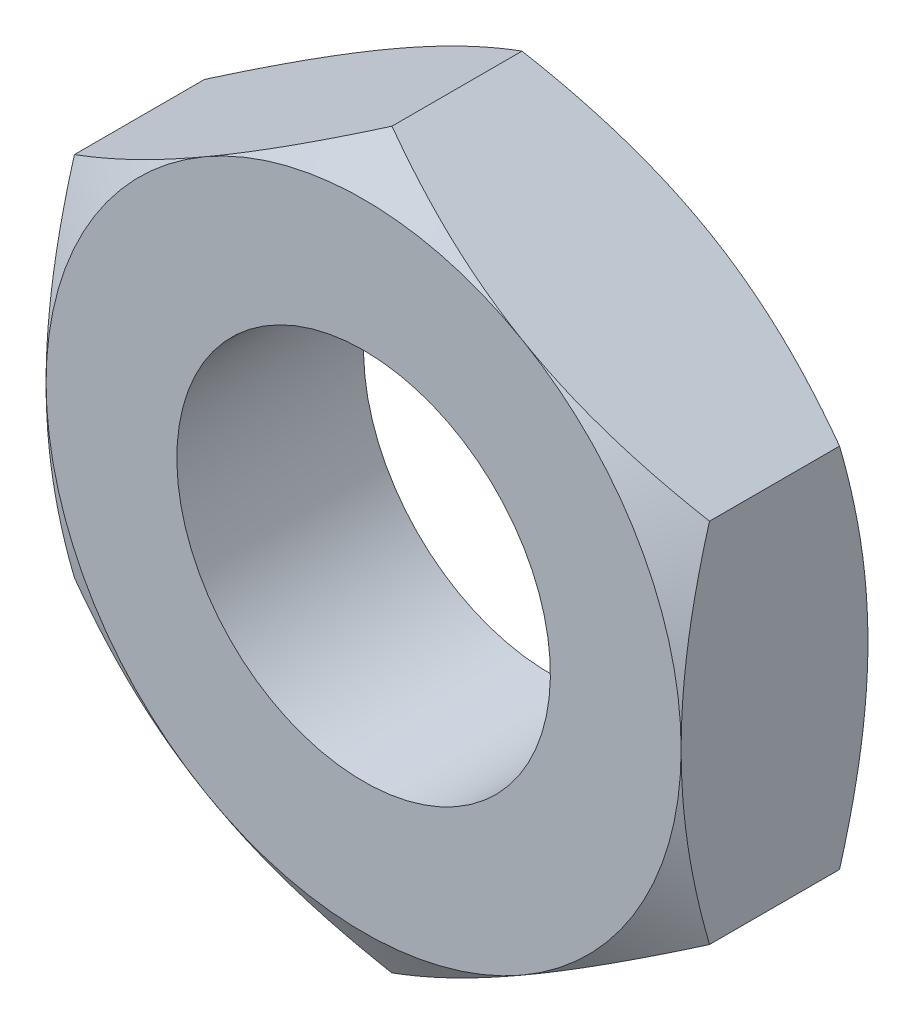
ISO-10303-21;
HEADER;
FILE_DESCRIPTION(('STEP AP214'),'2;1');
FILE_NAME('part.step','',(''),(''),'','','');
FILE_SCHEMA(('AUTOMOTIVE_DESIGN { 1 0 10303 214 1 1 1 1 }'));
ENDSEC;
DATA;
#1=APPLICATION_CONTEXT('core data for automotive mechanical design processes');
#2=APPLICATION_PROTOCOL_DEFINITION('international standard','automotive_design',2000,#1);
#3=PRODUCT_CONTEXT('',#1,'mechanical');
#4=PRODUCT('Part','Part','',(#3));
#5=PRODUCT_RELATED_PRODUCT_CATEGORY('part','',(#4));
#6=PRODUCT_DEFINITION_FORMATION('','',#4);
#7=PRODUCT_DEFINITION_CONTEXT('part definition',#1,'design');
#8=PRODUCT_DEFINITION('design','',#6,#7);
#9=PRODUCT_DEFINITION_SHAPE('','',#8);
#10=(LENGTH_UNIT() NAMED_UNIT(*) SI_UNIT(.MILLI.,.METRE.));
#11=(NAMED_UNIT(*) PLANE_ANGLE_UNIT() SI_UNIT($,.RADIAN.));
#12=(NAMED_UNIT(*) SI_UNIT($,.STERADIAN.) SOLID_ANGLE_UNIT());
#13=UNCERTAINTY_MEASURE_WITH_UNIT(LENGTH_MEASURE(1.E-05),#10,'distance_accuracy_value','');
#14=(GEOMETRIC_REPRESENTATION_CONTEXT(3) GLOBAL_UNCERTAINTY_ASSIGNED_CONTEXT((#13)) GLOBAL_UNIT_ASSIGNED_CONTEXT((#10,
#11,#12)) REPRESENTATION_CONTEXT('',''));
#15=CARTESIAN_POINT('',(0.,0.,0.));
#16=DIRECTION('',(0.,0.,1.));
#17=DIRECTION('',(1.,0.,0.));
#18=AXIS2_PLACEMENT_3D('',#15,#16,#17);
#19=CARTESIAN_POINT('',(0.,0.,5.));
#20=DIRECTION('',(0.,0.,-1.));
#21=DIRECTION('',(-1.,0.,0.));
#22=AXIS2_PLACEMENT_3D('',#19,#20,#21);
#23=CONICAL_SURFACE('',#22,8.5,1.04719755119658);
#24=CARTESIAN_POINT('',(0.000200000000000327,9.81507004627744,4.24074395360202));
#25=CARTESIAN_POINT('',(-0.18663922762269,9.7071983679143,4.30301386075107));
#26=CARTESIAN_POINT('',(-0.374175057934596,9.59892450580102,4.36245770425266));
#27=CARTESIAN_POINT('',(-0.750769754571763,9.38149745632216,4.47491488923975));
#28=CARTESIAN_POINT('',(-0.939829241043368,9.27234391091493,4.52792545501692));
#29=CARTESIAN_POINT('',(-1.5100347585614,8.94313560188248,4.67626661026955));
#30=CARTESIAN_POINT('',(-1.89343164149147,8.72178130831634,4.76064107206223));
#31=CARTESIAN_POINT('',(-2.46717766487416,8.39052888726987,4.85957998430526));
#32=CARTESIAN_POINT('',(-2.65581276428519,8.2816203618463,4.88776480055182));
#33=CARTESIAN_POINT('',(-3.03393602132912,8.06331079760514,4.93502591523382));
#34=CARTESIAN_POINT('',(-3.22342410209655,7.95390980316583,4.95410301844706));
#35=CARTESIAN_POINT('',(-3.60272652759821,7.73491944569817,4.98266522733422));
#36=CARTESIAN_POINT('',(-3.7925402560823,7.62533043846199,4.99216121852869));
#37=CARTESIAN_POINT('',(-4.17234305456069,7.40605119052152,5.00135762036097));
#38=CARTESIAN_POINT('',(-4.36233211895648,7.29636095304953,5.00105833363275));
#39=CARTESIAN_POINT('',(-4.71752301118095,7.09129139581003,4.99134552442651));
#40=CARTESIAN_POINT('',(-4.88274990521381,6.99589760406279,4.98311683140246));
#41=CARTESIAN_POINT('',(-5.21281671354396,6.80533344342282,4.95941075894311));
#42=CARTESIAN_POINT('',(-5.37765660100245,6.71016309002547,4.94393289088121));
#43=CARTESIAN_POINT('',(-5.87153810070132,6.42502047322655,4.88699137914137));
#44=CARTESIAN_POINT('',(-6.19970550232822,6.23555293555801,4.8350269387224));
#45=CARTESIAN_POINT('',(-6.85952142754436,5.85460803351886,4.70511505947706));
#46=CARTESIAN_POINT('',(-7.19108574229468,5.66317928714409,4.62661693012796));
#47=CARTESIAN_POINT('',(-7.84926989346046,5.28317649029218,4.44845866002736));
#48=CARTESIAN_POINT('',(-8.17589815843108,5.09459757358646,4.34884036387));
#49=CARTESIAN_POINT('',(-8.5002,4.90736181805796,4.240743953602));
#50=B_SPLINE_CURVE_WITH_KNOTS('',3,(#24,#25,#26,#27,#28,#29,#30,#31,#32,#33,#34,#35,#36,#37,#38,
#39,#40,#41,#42,#43,#44,#45,#46,#47,#48,#49),.UNSPECIFIED.,.F.,.F.,(4,2,2,2,2,2,2,2,2,2,2,2,4),
(0.,0.673596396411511,1.34748239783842,2.69805431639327,3.35679995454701,4.01548737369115,
4.67342558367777,5.33134346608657,5.90409556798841,6.47688628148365,7.62328361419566,
8.79510569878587,9.96462743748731),.UNSPECIFIED.);
#51=CARTESIAN_POINT('',(-4.25,7.36121593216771,5.));
#52=VERTEX_POINT('',#51);
#53=CARTESIAN_POINT('',(-8.5,4.9074772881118,4.24081062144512));
#54=VERTEX_POINT('',#53);
#55=EDGE_CURVE('E186',#52,#54,#50,.T.);
#56=ORIENTED_EDGE('',*,*,#55,.T.);
#57=CARTESIAN_POINT('',(-8.5,-13.2583613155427,0.814730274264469));
#58=CARTESIAN_POINT('',(-8.5,-12.8864728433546,0.995434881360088));
#59=CARTESIAN_POINT('',(-8.5,-12.5137388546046,1.17442879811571));
#60=CARTESIAN_POINT('',(-8.5,-11.7661304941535,1.52803467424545));
#61=CARTESIAN_POINT('',(-8.5,-11.3912558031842,1.70264595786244));
#62=CARTESIAN_POINT('',(-8.5,-10.6370214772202,2.04738824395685));
#63=CARTESIAN_POINT('',(-8.5,-10.2576485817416,2.21749033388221));
#64=CARTESIAN_POINT('',(-8.5,-9.4959121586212,2.55083491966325));
#65=CARTESIAN_POINT('',(-8.5,-9.11354877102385,2.71407773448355));
#66=CARTESIAN_POINT('',(-8.5,-8.33257141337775,3.03712878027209));
#67=CARTESIAN_POINT('',(-8.5,-7.93383684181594,3.19664704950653));
#68=CARTESIAN_POINT('',(-8.5,-7.13173193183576,3.50379441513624));
#69=CARTESIAN_POINT('',(-8.5,-6.72836108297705,3.65142218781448));
#70=CARTESIAN_POINT('',(-8.5,-5.91706772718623,3.93096834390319));
#71=CARTESIAN_POINT('',(-8.5,-5.50915607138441,4.06291788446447));
#72=CARTESIAN_POINT('',(-8.5,-4.68749602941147,4.30692544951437));
#73=CARTESIAN_POINT('',(-8.5,-4.27374950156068,4.41898965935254));
#74=CARTESIAN_POINT('',(-8.5,-3.44243879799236,4.61728915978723));
#75=CARTESIAN_POINT('',(-8.5,-3.02490979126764,4.70366793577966));
#76=CARTESIAN_POINT('',(-8.5,-2.39475362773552,4.81027425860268));
#77=CARTESIAN_POINT('',(-8.5,-2.18404284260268,4.8419841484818));
#78=CARTESIAN_POINT('',(-8.5,-1.76154817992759,4.89712987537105));
#79=CARTESIAN_POINT('',(-8.5,-1.54976440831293,4.92056651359));
#80=CARTESIAN_POINT('',(-8.5,-1.12820729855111,4.95840086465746));
#81=CARTESIAN_POINT('',(-8.5,-0.91844434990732,4.97291386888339));
#82=CARTESIAN_POINT('',(-8.5,-0.498492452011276,4.99305243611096));
#83=CARTESIAN_POINT('',(-8.5,-0.288303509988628,4.99867814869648));
#84=CARTESIAN_POINT('',(-8.5,0.13212380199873,5.00090766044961));
#85=CARTESIAN_POINT('',(-8.5,0.342362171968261,4.99751145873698));
#86=CARTESIAN_POINT('',(-8.5,0.762506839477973,4.98178120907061));
#87=CARTESIAN_POINT('',(-8.5,0.972413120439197,4.96944672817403));
#88=CARTESIAN_POINT('',(-8.5,1.47459584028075,4.92950835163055));
#89=CARTESIAN_POINT('',(-8.5,1.76655222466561,4.89779057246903));
#90=CARTESIAN_POINT('',(-8.5,2.34833414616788,4.81877651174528));
#91=CARTESIAN_POINT('',(-8.5,2.63815939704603,4.77147817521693));
#92=CARTESIAN_POINT('',(-8.5,3.50408791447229,4.60871721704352));
#93=CARTESIAN_POINT('',(-8.5,4.07632839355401,4.47241710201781));
#94=CARTESIAN_POINT('',(-8.5,4.9320574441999,4.23560024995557));
#95=CARTESIAN_POINT('',(-8.5,5.2199728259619,4.15015539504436));
#96=CARTESIAN_POINT('',(-8.5,5.79300843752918,3.97027401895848));
#97=CARTESIAN_POINT('',(-8.5,6.07812864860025,3.8758374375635));
#98=CARTESIAN_POINT('',(-8.5,6.64566101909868,3.67949746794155));
#99=CARTESIAN_POINT('',(-8.5,6.92807400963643,3.57759646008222));
#100=CARTESIAN_POINT('',(-8.5,7.49055258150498,3.36753821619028));
#101=CARTESIAN_POINT('',(-8.5,7.77061819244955,3.25938105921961));
#102=CARTESIAN_POINT('',(-8.5,8.43950907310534,2.99384209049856));
#103=CARTESIAN_POINT('',(-8.5,8.82734518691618,2.83397298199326));
#104=CARTESIAN_POINT('',(-8.5,9.59963868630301,2.50624803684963));
#105=CARTESIAN_POINT('',(-8.5,9.98409584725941,2.33839167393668));
#106=CARTESIAN_POINT('',(-8.5,10.7502727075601,1.99631700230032));
#107=CARTESIAN_POINT('',(-8.5,11.1319917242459,1.82209716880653));
#108=CARTESIAN_POINT('',(-8.5,11.8930641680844,1.46860050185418));
#109=CARTESIAN_POINT('',(-8.5,12.2724176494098,1.28932378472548));
#110=CARTESIAN_POINT('',(-8.5,13.0295958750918,0.926465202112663));
#111=CARTESIAN_POINT('',(-8.5,13.4074183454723,0.742878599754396));
#112=CARTESIAN_POINT('',(-8.5,14.1614093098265,0.372341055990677));
#113=CARTESIAN_POINT('',(-8.5,14.5375777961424,0.185390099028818));
#114=CARTESIAN_POINT('',(-8.5,15.6638995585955,-0.379549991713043));
#115=CARTESIAN_POINT('',(-8.5,16.4119764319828,-0.761678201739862));
#116=CARTESIAN_POINT('',(-8.5,17.8399453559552,-1.50045352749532));
#117=CARTESIAN_POINT('',(-8.5,18.5201676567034,-1.85646521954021));
#118=CARTESIAN_POINT('',(-8.5,19.8780810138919,-2.57334253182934));
#119=CARTESIAN_POINT('',(-8.5,20.5557719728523,-2.9342083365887));
#120=CARTESIAN_POINT('',(-8.5,21.9074097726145,-3.65867559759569));
#121=CARTESIAN_POINT('',(-8.5,22.5813617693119,-4.02226745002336));
#122=CARTESIAN_POINT('',(-8.5,23.9276518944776,-4.75233522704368));
#123=CARTESIAN_POINT('',(-8.5,24.5999901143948,-5.11881098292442));
#124=CARTESIAN_POINT('',(-8.5,25.2717370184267,-5.48636013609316));
#125=B_SPLINE_CURVE_WITH_KNOTS('',3,(#57,#58,#59,#60,#61,#62,#63,#64,#65,#66,#67,#68,#69,#70,
#71,#72,#73,#74,#75,#76,#77,#78,#79,#80,#81,#82,#83,#84,#85,#86,#87,#88,#89,#90,#91,#92,#93,#94,
#95,#96,#97,#98,#99,#100,#101,#102,#103,#104,#105,#106,#107,#108,#109,#110,#111,#112,#113,#114,
#115,#116,#117,#118,#119,#120,#121,#122,#123,#124),.UNSPECIFIED.,.F.,.F.,(4,2,2,2,2,2,2,2,2,2,2,
2,2,2,2,2,2,2,2,2,2,2,2,2,2,2,2,2,2,2,2,2,2,4),(0.,1.24041661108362,2.4810233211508,
3.72825657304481,4.97543176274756,6.26366261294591,7.55203667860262,8.83780596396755,
10.1231746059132,11.4012218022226,12.0403353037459,12.6793868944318,13.3099983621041,
13.9405992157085,14.5712001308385,15.2018315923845,16.0823582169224,16.9630010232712,
18.725232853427,19.6261358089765,20.5270447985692,21.4276677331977,22.3282792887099,
23.586638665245,24.8450810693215,26.1038270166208,27.3625440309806,28.6227160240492,
29.8828938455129,32.402892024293,34.7061342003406,37.0094641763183,39.306779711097,
41.6039618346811),.UNSPECIFIED.);
#126=CARTESIAN_POINT('',(-8.5,0.,5.));
#127=VERTEX_POINT('',#126);
#128=EDGE_CURVE('E210',#54,#127,#125,.F.);
#129=ORIENTED_EDGE('',*,*,#128,.T.);
#130=CARTESIAN_POINT('',(0.,0.,5.));
#131=DIRECTION('',(0.,0.,-1.));
#132=DIRECTION('',(-1.,0.,0.));
#133=AXIS2_PLACEMENT_3D('',#130,#131,#132);
#134=CIRCLE('',#133,8.5);
#135=EDGE_CURVE('E281',#127,#52,#134,.T.);
#136=ORIENTED_EDGE('',*,*,#135,.T.);
#137=EDGE_LOOP('',(#56,#129,#136));
#138=FACE_BOUND('',#137,.T.);
#139=ADVANCED_FACE('F14',(#138),#23,.T.);
#140=CARTESIAN_POINT('',(-4.25,-7.36121593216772,5.));
#141=VERTEX_POINT('',#140);
#142=EDGE_CURVE('E280',#141,#127,#134,.T.);
#143=ORIENTED_EDGE('',*,*,#142,.T.);
#144=CARTESIAN_POINT('',(-8.5,-4.9074772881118,4.24081062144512));
#145=VERTEX_POINT('',#144);
#146=EDGE_CURVE('E203',#127,#145,#125,.F.);
#147=ORIENTED_EDGE('',*,*,#146,.T.);
#148=CARTESIAN_POINT('',(-8.5002,-4.90736181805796,4.240743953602));
#149=CARTESIAN_POINT('',(-8.31336077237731,-5.0152334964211,4.30301386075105));
#150=CARTESIAN_POINT('',(-8.1258249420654,-5.12350735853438,4.36245770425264));
#151=CARTESIAN_POINT('',(-7.74923024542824,-5.34093440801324,4.47491488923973));
#152=CARTESIAN_POINT('',(-7.56017075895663,-5.45008795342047,4.5279254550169));
#153=CARTESIAN_POINT('',(-6.9899652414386,-5.77929626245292,4.67626661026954));
#154=CARTESIAN_POINT('',(-6.60656835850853,-6.00065055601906,4.76064107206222));
#155=CARTESIAN_POINT('',(-6.03282233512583,-6.33190297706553,4.85957998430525));
#156=CARTESIAN_POINT('',(-5.84418723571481,-6.4408115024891,4.88776480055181));
#157=CARTESIAN_POINT('',(-5.46606397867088,-6.65912106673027,4.93502591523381));
#158=CARTESIAN_POINT('',(-5.27657589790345,-6.76852206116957,4.95410301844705));
#159=CARTESIAN_POINT('',(-4.89727347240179,-6.98751241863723,4.98266522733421));
#160=CARTESIAN_POINT('',(-4.7074597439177,-7.09710142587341,4.99216121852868));
#161=CARTESIAN_POINT('',(-4.3276569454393,-7.31638067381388,5.00135762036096));
#162=CARTESIAN_POINT('',(-4.13766788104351,-7.42607091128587,5.00105833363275));
#163=CARTESIAN_POINT('',(-3.78247698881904,-7.63114046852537,4.99134552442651));
#164=CARTESIAN_POINT('',(-3.61725009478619,-7.72653426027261,4.98311683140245));
#165=CARTESIAN_POINT('',(-3.28718328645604,-7.91709842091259,4.9594107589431));
#166=CARTESIAN_POINT('',(-3.12234339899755,-8.01226877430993,4.94393289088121));
#167=CARTESIAN_POINT('',(-2.62846189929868,-8.29741139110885,4.88699137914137));
#168=CARTESIAN_POINT('',(-2.30029449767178,-8.4868789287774,4.83502693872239));
#169=CARTESIAN_POINT('',(-1.64047857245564,-8.86782383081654,4.70511505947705));
#170=CARTESIAN_POINT('',(-1.30891425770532,-9.05925257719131,4.62661693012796));
#171=CARTESIAN_POINT('',(-0.650730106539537,-9.43925537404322,4.44845866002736));
#172=CARTESIAN_POINT('',(-0.324101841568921,-9.62783429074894,4.34884036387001));
#173=CARTESIAN_POINT('',(0.000200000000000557,-9.81507004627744,4.24074395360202));
#174=B_SPLINE_CURVE_WITH_KNOTS('',3,(#148,#149,#150,#151,#152,#153,#154,#155,#156,#157,#158,
#159,#160,#161,#162,#163,#164,#165,#166,#167,#168,#169,#170,#171,#172,#173),.UNSPECIFIED.,.F.,
.F.,(4,2,2,2,2,2,2,2,2,2,2,2,4),(0.,0.673596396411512,1.34748239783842,2.69805431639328,
3.35679995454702,4.01548737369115,4.67342558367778,5.33134346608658,5.90409556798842,
6.47688628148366,7.62328361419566,8.79510569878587,9.96462743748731),.UNSPECIFIED.);
#175=EDGE_CURVE('E332',#145,#141,#174,.T.);
#176=ORIENTED_EDGE('',*,*,#175,.T.);
#177=EDGE_LOOP('',(#143,#147,#176));
#178=FACE_BOUND('',#177,.T.);
#179=ADVANCED_FACE('F243',(#178),#23,.T.);
#180=CARTESIAN_POINT('',(4.25,-7.36121593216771,5.));
#181=VERTEX_POINT('',#180);
#182=EDGE_CURVE('E277',#181,#141,#134,.T.);
#183=ORIENTED_EDGE('',*,*,#182,.T.);
#184=CARTESIAN_POINT('',(0.,-9.8149545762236,4.24081062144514));
#185=VERTEX_POINT('',#184);
#186=EDGE_CURVE('E219',#141,#185,#174,.T.);
#187=ORIENTED_EDGE('',*,*,#186,.T.);
#188=CARTESIAN_POINT('',(-0.000199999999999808,-9.81507004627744,4.24074395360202));
#189=CARTESIAN_POINT('',(0.186639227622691,-9.7071983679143,4.30301386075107));
#190=CARTESIAN_POINT('',(0.374175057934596,-9.59892450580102,4.36245770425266));
#191=CARTESIAN_POINT('',(0.750769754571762,-9.38149745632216,4.47491488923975));
#192=CARTESIAN_POINT('',(0.939829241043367,-9.27234391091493,4.52792545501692));
#193=CARTESIAN_POINT('',(1.5100347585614,-8.94313560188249,4.67626661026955));
#194=CARTESIAN_POINT('',(1.89343164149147,-8.72178130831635,4.76064107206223));
#195=CARTESIAN_POINT('',(2.46717766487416,-8.39052888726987,4.85957998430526));
#196=CARTESIAN_POINT('',(2.65581276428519,-8.2816203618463,4.88776480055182));
#197=CARTESIAN_POINT('',(3.03393602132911,-8.06331079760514,4.93502591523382));
#198=CARTESIAN_POINT('',(3.22342410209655,-7.95390980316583,4.95410301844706));
#199=CARTESIAN_POINT('',(3.60272652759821,-7.73491944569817,4.98266522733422));
#200=CARTESIAN_POINT('',(3.7925402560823,-7.62533043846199,4.99216121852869));
#201=CARTESIAN_POINT('',(4.17234305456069,-7.40605119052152,5.00135762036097));
#202=CARTESIAN_POINT('',(4.36233211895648,-7.29636095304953,5.00105833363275));
#203=CARTESIAN_POINT('',(4.71752301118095,-7.09129139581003,4.99134552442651));
#204=CARTESIAN_POINT('',(4.88274990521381,-6.99589760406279,4.98311683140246));
#205=CARTESIAN_POINT('',(5.21281671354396,-6.80533344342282,4.95941075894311));
#206=CARTESIAN_POINT('',(5.37765660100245,-6.71016309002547,4.94393289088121));
#207=CARTESIAN_POINT('',(5.87153810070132,-6.42502047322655,4.88699137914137));
#208=CARTESIAN_POINT('',(6.19970550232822,-6.23555293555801,4.8350269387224));
#209=CARTESIAN_POINT('',(6.85952142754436,-5.85460803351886,4.70511505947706));
#210=CARTESIAN_POINT('',(7.19108574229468,-5.66317928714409,4.62661693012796));
#211=CARTESIAN_POINT('',(7.84926989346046,-5.28317649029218,4.44845866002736));
#212=CARTESIAN_POINT('',(8.17589815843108,-5.09459757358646,4.34884036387));
#213=CARTESIAN_POINT('',(8.5002,-4.90736181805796,4.240743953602));
#214=B_SPLINE_CURVE_WITH_KNOTS('',3,(#188,#189,#190,#191,#192,#193,#194,#195,#196,#197,#198,
#199,#200,#201,#202,#203,#204,#205,#206,#207,#208,#209,#210,#211,#212,#213),.UNSPECIFIED.,.F.,
.F.,(4,2,2,2,2,2,2,2,2,2,2,2,4),(0.,0.673596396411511,1.34748239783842,2.69805431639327,
3.35679995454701,4.01548737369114,4.67342558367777,5.33134346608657,5.90409556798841,
6.47688628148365,7.62328361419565,8.79510569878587,9.96462743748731),.UNSPECIFIED.);
#215=EDGE_CURVE('E288',#185,#181,#214,.T.);
#216=ORIENTED_EDGE('',*,*,#215,.T.);
#217=EDGE_LOOP('',(#183,#187,#216));
#218=FACE_BOUND('',#217,.T.);
#219=ADVANCED_FACE('F248',(#218),#23,.T.);
#220=CARTESIAN_POINT('',(8.5002,4.90736181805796,4.240743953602));
#221=CARTESIAN_POINT('',(8.31336077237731,5.0152334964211,4.30301386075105));
#222=CARTESIAN_POINT('',(8.1258249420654,5.12350735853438,4.36245770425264));
#223=CARTESIAN_POINT('',(7.74923024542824,5.34093440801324,4.47491488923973));
#224=CARTESIAN_POINT('',(7.56017075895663,5.45008795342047,4.5279254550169));
#225=CARTESIAN_POINT('',(6.9899652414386,5.77929626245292,4.67626661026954));
#226=CARTESIAN_POINT('',(6.60656835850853,6.00065055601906,4.76064107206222));
#227=CARTESIAN_POINT('',(6.03282233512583,6.33190297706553,4.85957998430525));
#228=CARTESIAN_POINT('',(5.84418723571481,6.4408115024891,4.88776480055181));
#229=CARTESIAN_POINT('',(5.46606397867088,6.65912106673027,4.93502591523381));
#230=CARTESIAN_POINT('',(5.27657589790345,6.76852206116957,4.95410301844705));
#231=CARTESIAN_POINT('',(4.89727347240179,6.98751241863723,4.98266522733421));
#232=CARTESIAN_POINT('',(4.70745974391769,7.09710142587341,4.99216121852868));
#233=CARTESIAN_POINT('',(4.3276569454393,7.31638067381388,5.00135762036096));
#234=CARTESIAN_POINT('',(4.13766788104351,7.42607091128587,5.00105833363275));
#235=CARTESIAN_POINT('',(3.78247698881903,7.63114046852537,4.99134552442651));
#236=CARTESIAN_POINT('',(3.61725009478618,7.72653426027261,4.98311683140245));
#237=CARTESIAN_POINT('',(3.28718328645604,7.91709842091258,4.9594107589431));
#238=CARTESIAN_POINT('',(3.12234339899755,8.01226877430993,4.94393289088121));
#239=CARTESIAN_POINT('',(2.62846189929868,8.29741139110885,4.88699137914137));
#240=CARTESIAN_POINT('',(2.30029449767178,8.4868789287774,4.8350269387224));
#241=CARTESIAN_POINT('',(1.64047857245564,8.86782383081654,4.70511505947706));
#242=CARTESIAN_POINT('',(1.30891425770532,9.05925257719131,4.62661693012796));
#243=CARTESIAN_POINT('',(0.650730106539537,9.43925537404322,4.44845866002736));
#244=CARTESIAN_POINT('',(0.324101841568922,9.62783429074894,4.34884036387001));
#245=CARTESIAN_POINT('',(-0.000199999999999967,9.81507004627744,4.24074395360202));
#246=B_SPLINE_CURVE_WITH_KNOTS('',3,(#220,#221,#222,#223,#224,#225,#226,#227,#228,#229,#230,
#231,#232,#233,#234,#235,#236,#237,#238,#239,#240,#241,#242,#243,#244,#245),.UNSPECIFIED.,.F.,
.F.,(4,2,2,2,2,2,2,2,2,2,2,2,4),(0.,0.673596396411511,1.34748239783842,2.69805431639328,
3.35679995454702,4.01548737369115,4.67342558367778,5.33134346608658,5.90409556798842,
6.47688628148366,7.62328361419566,8.79510569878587,9.96462743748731),.UNSPECIFIED.);
#247=CARTESIAN_POINT('',(4.25,7.36121593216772,5.));
#248=VERTEX_POINT('',#247);
#249=CARTESIAN_POINT('',(0.,9.8149545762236,4.24081062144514));
#250=VERTEX_POINT('',#249);
#251=EDGE_CURVE('E141',#248,#250,#246,.T.);
#252=ORIENTED_EDGE('',*,*,#251,.T.);
#253=EDGE_CURVE('E193',#250,#52,#50,.T.);
#254=ORIENTED_EDGE('',*,*,#253,.T.);
#255=EDGE_CURVE('E278',#52,#248,#134,.T.);
#256=ORIENTED_EDGE('',*,*,#255,.T.);
#257=EDGE_LOOP('',(#252,#254,#256));
#258=FACE_BOUND('',#257,.T.);
#259=ADVANCED_FACE('F259',(#258),#23,.T.);
#260=CARTESIAN_POINT('',(8.5,0.,5.));
#261=VERTEX_POINT('',#260);
#262=EDGE_CURVE('E271',#261,#181,#134,.T.);
#263=ORIENTED_EDGE('',*,*,#262,.T.);
#264=CARTESIAN_POINT('',(8.5,-4.9074772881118,4.24081062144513));
#265=VERTEX_POINT('',#264);
#266=EDGE_CURVE('E272',#181,#265,#214,.T.);
#267=ORIENTED_EDGE('',*,*,#266,.T.);
#268=CARTESIAN_POINT('',(8.5,-13.2583613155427,0.81473027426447));
#269=CARTESIAN_POINT('',(8.5,-12.8864728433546,0.99543488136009));
#270=CARTESIAN_POINT('',(8.5,-12.5137388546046,1.17442879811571));
#271=CARTESIAN_POINT('',(8.5,-11.7661304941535,1.52803467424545));
#272=CARTESIAN_POINT('',(8.5,-11.3912558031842,1.70264595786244));
#273=CARTESIAN_POINT('',(8.5,-10.6370214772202,2.04738824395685));
#274=CARTESIAN_POINT('',(8.5,-10.2576485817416,2.21749033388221));
#275=CARTESIAN_POINT('',(8.5,-9.49591215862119,2.55083491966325));
#276=CARTESIAN_POINT('',(8.5,-9.11354877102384,2.71407773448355));
#277=CARTESIAN_POINT('',(8.5,-8.33257141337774,3.0371287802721));
#278=CARTESIAN_POINT('',(8.5,-7.93383684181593,3.19664704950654));
#279=CARTESIAN_POINT('',(8.5,-7.13173193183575,3.50379441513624));
#280=CARTESIAN_POINT('',(8.5,-6.72836108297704,3.65142218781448));
#281=CARTESIAN_POINT('',(8.5,-5.91706772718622,3.93096834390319));
#282=CARTESIAN_POINT('',(8.5,-5.50915607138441,4.06291788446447));
#283=CARTESIAN_POINT('',(8.5,-4.68749602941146,4.30692544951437));
#284=CARTESIAN_POINT('',(8.5,-4.27374950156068,4.41898965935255));
#285=CARTESIAN_POINT('',(8.5,-3.44243879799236,4.61728915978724));
#286=CARTESIAN_POINT('',(8.5,-3.02490979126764,4.70366793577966));
#287=CARTESIAN_POINT('',(8.5,-2.39475362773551,4.81027425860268));
#288=CARTESIAN_POINT('',(8.5,-2.18404284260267,4.8419841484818));
#289=CARTESIAN_POINT('',(8.5,-1.76154817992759,4.89712987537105));
#290=CARTESIAN_POINT('',(8.5,-1.54976440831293,4.92056651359));
#291=CARTESIAN_POINT('',(8.5,-1.12820729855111,4.95840086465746));
#292=CARTESIAN_POINT('',(8.5,-0.91844434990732,4.97291386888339));
#293=CARTESIAN_POINT('',(8.5,-0.498492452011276,4.99305243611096));
#294=CARTESIAN_POINT('',(8.5,-0.288303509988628,4.99867814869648));
#295=CARTESIAN_POINT('',(8.5,0.13212380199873,5.00090766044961));
#296=CARTESIAN_POINT('',(8.5,0.34236217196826,4.99751145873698));
#297=CARTESIAN_POINT('',(8.5,0.762506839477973,4.98178120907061));
#298=CARTESIAN_POINT('',(8.5,0.972413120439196,4.96944672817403));
#299=CARTESIAN_POINT('',(8.5,1.47459584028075,4.92950835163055));
#300=CARTESIAN_POINT('',(8.5,1.76655222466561,4.89779057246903));
#301=CARTESIAN_POINT('',(8.5,2.34833414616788,4.81877651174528));
#302=CARTESIAN_POINT('',(8.5,2.63815939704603,4.77147817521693));
#303=CARTESIAN_POINT('',(8.5,3.50408791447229,4.60871721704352));
#304=CARTESIAN_POINT('',(8.5,4.07632839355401,4.47241710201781));
#305=CARTESIAN_POINT('',(8.5,4.9320574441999,4.23560024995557));
#306=CARTESIAN_POINT('',(8.5,5.2199728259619,4.15015539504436));
#307=CARTESIAN_POINT('',(8.5,5.79300843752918,3.97027401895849));
#308=CARTESIAN_POINT('',(8.5,6.07812864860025,3.8758374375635));
#309=CARTESIAN_POINT('',(8.5,6.64566101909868,3.67949746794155));
#310=CARTESIAN_POINT('',(8.5,6.92807400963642,3.57759646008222));
#311=CARTESIAN_POINT('',(8.5,7.49055258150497,3.36753821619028));
#312=CARTESIAN_POINT('',(8.5,7.77061819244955,3.25938105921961));
#313=CARTESIAN_POINT('',(8.5,8.43950907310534,2.99384209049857));
#314=CARTESIAN_POINT('',(8.5,8.82734518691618,2.83397298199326));
#315=CARTESIAN_POINT('',(8.5,9.599638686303,2.50624803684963));
#316=CARTESIAN_POINT('',(8.5,9.98409584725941,2.33839167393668));
#317=CARTESIAN_POINT('',(8.5,10.7502727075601,1.99631700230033));
#318=CARTESIAN_POINT('',(8.5,11.1319917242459,1.82209716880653));
#319=CARTESIAN_POINT('',(8.5,11.8930641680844,1.46860050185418));
#320=CARTESIAN_POINT('',(8.5,12.2724176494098,1.28932378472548));
#321=CARTESIAN_POINT('',(8.5,13.0295958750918,0.926465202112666));
#322=CARTESIAN_POINT('',(8.5,13.4074183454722,0.742878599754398));
#323=CARTESIAN_POINT('',(8.5,14.1614093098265,0.372341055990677));
#324=CARTESIAN_POINT('',(8.5,14.5375777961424,0.185390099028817));
#325=CARTESIAN_POINT('',(8.5,15.6638995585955,-0.379549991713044));
#326=CARTESIAN_POINT('',(8.5,16.4119764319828,-0.761678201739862));
#327=CARTESIAN_POINT('',(8.5,17.8399453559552,-1.50045352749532));
#328=CARTESIAN_POINT('',(8.5,18.5201676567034,-1.85646521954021));
#329=CARTESIAN_POINT('',(8.5,19.8780810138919,-2.57334253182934));
#330=CARTESIAN_POINT('',(8.5,20.5557719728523,-2.9342083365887));
#331=CARTESIAN_POINT('',(8.5,21.9074097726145,-3.65867559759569));
#332=CARTESIAN_POINT('',(8.5,22.5813617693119,-4.02226745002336));
#333=CARTESIAN_POINT('',(8.5,23.9276518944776,-4.75233522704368));
#334=CARTESIAN_POINT('',(8.5,24.5999901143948,-5.11881098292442));
#335=CARTESIAN_POINT('',(8.5,25.2717370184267,-5.48636013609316));
#336=B_SPLINE_CURVE_WITH_KNOTS('',3,(#268,#269,#270,#271,#272,#273,#274,#275,#276,#277,#278,
#279,#280,#281,#282,#283,#284,#285,#286,#287,#288,#289,#290,#291,#292,#293,#294,#295,#296,#297,
#298,#299,#300,#301,#302,#303,#304,#305,#306,#307,#308,#309,#310,#311,#312,#313,#314,#315,#316,
#317,#318,#319,#320,#321,#322,#323,#324,#325,#326,#327,#328,#329,#330,#331,#332,#333,#334,#335),
.UNSPECIFIED.,.F.,.F.,(4,2,2,2,2,2,2,2,2,2,2,2,2,2,2,2,2,2,2,2,2,2,2,2,2,2,2,2,2,2,2,2,2,4),(0.,
1.24041661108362,2.48102332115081,3.72825657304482,4.97543176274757,6.26366261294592,
7.55203667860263,8.83780596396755,10.1231746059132,11.4012218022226,12.0403353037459,
12.6793868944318,13.3099983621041,13.9405992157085,14.5712001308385,15.2018315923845,
16.0823582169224,16.9630010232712,18.725232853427,19.6261358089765,20.5270447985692,
21.4276677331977,22.3282792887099,23.586638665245,24.8450810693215,26.1038270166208,
27.3625440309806,28.6227160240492,29.8828938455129,32.402892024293,34.7061342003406,
37.0094641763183,39.306779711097,41.6039618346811),.UNSPECIFIED.);
#337=EDGE_CURVE('E146',#265,#261,#336,.T.);
#338=ORIENTED_EDGE('',*,*,#337,.T.);
#339=EDGE_LOOP('',(#263,#267,#338));
#340=FACE_BOUND('',#339,.T.);
#341=ADVANCED_FACE('F252',(#340),#23,.T.);
#342=CARTESIAN_POINT('',(0.,0.,2.5));
#343=DIRECTION('',(0.,0.,1.));
#344=DIRECTION('',(1.,0.,0.));
#345=AXIS2_PLACEMENT_3D('',#342,#343,#344);
#346=CONICAL_SURFACE('',#345,12.830127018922,1.04719755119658);
#347=CARTESIAN_POINT('',(8.5,-13.2583613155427,4.18526972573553));
#348=CARTESIAN_POINT('',(8.5,-12.8864728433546,4.00456511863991));
#349=CARTESIAN_POINT('',(8.5,-12.5137388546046,3.82557120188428));
#350=CARTESIAN_POINT('',(8.5,-11.7661304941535,3.47196532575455));
#351=CARTESIAN_POINT('',(8.5,-11.3912558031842,3.29735404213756));
#352=CARTESIAN_POINT('',(8.5,-10.6370214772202,2.95261175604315));
#353=CARTESIAN_POINT('',(8.5,-10.2576485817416,2.78250966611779));
#354=CARTESIAN_POINT('',(8.5,-9.49591215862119,2.44916508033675));
#355=CARTESIAN_POINT('',(8.5,-9.11354877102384,2.28592226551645));
#356=CARTESIAN_POINT('',(8.5,-8.33257141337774,1.9628712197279));
#357=CARTESIAN_POINT('',(8.5,-7.93383684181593,1.80335295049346));
#358=CARTESIAN_POINT('',(8.5,-7.13173193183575,1.49620558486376));
#359=CARTESIAN_POINT('',(8.5,-6.72836108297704,1.34857781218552));
#360=CARTESIAN_POINT('',(8.5,-5.91706772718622,1.0690316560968));
#361=CARTESIAN_POINT('',(8.5,-5.5091560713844,0.937082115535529));
#362=CARTESIAN_POINT('',(8.5,-4.68749602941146,0.693074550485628));
#363=CARTESIAN_POINT('',(8.5,-4.27374950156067,0.58101034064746));
#364=CARTESIAN_POINT('',(8.5,-3.44243879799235,0.382710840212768));
#365=CARTESIAN_POINT('',(8.5,-3.02490979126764,0.296332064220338));
#366=CARTESIAN_POINT('',(8.5,-2.39475362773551,0.189725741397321));
#367=CARTESIAN_POINT('',(8.5,-2.18404284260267,0.158015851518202));
#368=CARTESIAN_POINT('',(8.5,-1.76154817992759,0.102870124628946));
#369=CARTESIAN_POINT('',(8.5,-1.54976440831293,0.0794334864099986));
#370=CARTESIAN_POINT('',(8.5,-1.12820729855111,0.0415991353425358));
#371=CARTESIAN_POINT('',(8.5,-0.918444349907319,0.0270861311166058));
#372=CARTESIAN_POINT('',(8.5,-0.498492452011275,0.00694756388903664));
#373=CARTESIAN_POINT('',(8.5,-0.288303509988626,0.00132185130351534));
#374=CARTESIAN_POINT('',(8.5,0.132123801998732,-0.000907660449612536));
#375=CARTESIAN_POINT('',(8.5,0.342362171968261,0.00248854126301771));
#376=CARTESIAN_POINT('',(8.5,0.762506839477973,0.0182187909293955));
#377=CARTESIAN_POINT('',(8.5,0.972413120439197,0.0305532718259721));
#378=CARTESIAN_POINT('',(8.5,1.47459584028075,0.0704916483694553));
#379=CARTESIAN_POINT('',(8.5,1.76655222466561,0.102209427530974));
#380=CARTESIAN_POINT('',(8.5,2.34833414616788,0.181223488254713));
#381=CARTESIAN_POINT('',(8.5,2.63815939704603,0.228521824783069));
#382=CARTESIAN_POINT('',(8.5,3.50408791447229,0.391282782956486));
#383=CARTESIAN_POINT('',(8.5,4.07632839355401,0.527582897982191));
#384=CARTESIAN_POINT('',(8.5,4.9320574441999,0.764399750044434));
#385=CARTESIAN_POINT('',(8.5,5.2199728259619,0.849844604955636));
#386=CARTESIAN_POINT('',(8.5,5.79300843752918,1.02972598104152));
#387=CARTESIAN_POINT('',(8.5,6.07812864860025,1.1241625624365));
#388=CARTESIAN_POINT('',(8.5,6.64566101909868,1.32050253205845));
#389=CARTESIAN_POINT('',(8.5,6.92807400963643,1.42240353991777));
#390=CARTESIAN_POINT('',(8.5,7.49055258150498,1.63246178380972));
#391=CARTESIAN_POINT('',(8.5,7.77061819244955,1.74061894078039));
#392=CARTESIAN_POINT('',(8.5,8.43950907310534,2.00615790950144));
#393=CARTESIAN_POINT('',(8.5,8.82734518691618,2.16602701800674));
#394=CARTESIAN_POINT('',(8.5,9.59963868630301,2.49375196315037));
#395=CARTESIAN_POINT('',(8.5,9.98409584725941,2.66160832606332));
#396=CARTESIAN_POINT('',(8.5,10.7502727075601,3.00368299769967));
#397=CARTESIAN_POINT('',(8.5,11.1319917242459,3.17790283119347));
#398=CARTESIAN_POINT('',(8.5,11.8930641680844,3.53139949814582));
#399=CARTESIAN_POINT('',(8.5,12.2724176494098,3.71067621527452));
#400=CARTESIAN_POINT('',(8.5,13.0295958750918,4.07353479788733));
#401=CARTESIAN_POINT('',(8.5,13.4074183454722,4.2571214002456));
#402=CARTESIAN_POINT('',(8.5,14.1614093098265,4.62765894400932));
#403=CARTESIAN_POINT('',(8.5,14.5375777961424,4.81460990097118));
#404=CARTESIAN_POINT('',(8.5,15.6638995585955,5.37954999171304));
#405=CARTESIAN_POINT('',(8.5,16.4119764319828,5.76167820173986));
#406=CARTESIAN_POINT('',(8.5,17.8399453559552,6.50045352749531));
#407=CARTESIAN_POINT('',(8.5,18.5201676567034,6.8564652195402));
#408=CARTESIAN_POINT('',(8.5,19.8780810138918,7.57334253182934));
#409=CARTESIAN_POINT('',(8.5,20.5557719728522,7.9342083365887));
#410=CARTESIAN_POINT('',(8.5,21.9074097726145,8.65867559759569));
#411=CARTESIAN_POINT('',(8.5,22.5813617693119,9.02226745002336));
#412=CARTESIAN_POINT('',(8.5,23.9276518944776,9.75233522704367));
#413=CARTESIAN_POINT('',(8.5,24.5999901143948,10.1188109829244));
#414=CARTESIAN_POINT('',(8.5,25.2717370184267,10.4863601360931));
#415=B_SPLINE_CURVE_WITH_KNOTS('',3,(#347,#348,#349,#350,#351,#352,#353,#354,#355,#356,#357,
#358,#359,#360,#361,#362,#363,#364,#365,#366,#367,#368,#369,#370,#371,#372,#373,#374,#375,#376,
#377,#378,#379,#380,#381,#382,#383,#384,#385,#386,#387,#388,#389,#390,#391,#392,#393,#394,#395,
#396,#397,#398,#399,#400,#401,#402,#403,#404,#405,#406,#407,#408,#409,#410,#411,#412,#413,#414),
.UNSPECIFIED.,.F.,.F.,(4,2,2,2,2,2,2,2,2,2,2,2,2,2,2,2,2,2,2,2,2,2,2,2,2,2,2,2,2,2,2,2,2,4),(0.,
1.24041661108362,2.48102332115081,3.72825657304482,4.97543176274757,6.26366261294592,
7.55203667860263,8.83780596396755,10.1231746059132,11.4012218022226,12.0403353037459,
12.6793868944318,13.3099983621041,13.9405992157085,14.5712001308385,15.2018315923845,
16.0823582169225,16.9630010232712,18.725232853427,19.6261358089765,20.5270447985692,
21.4276677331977,22.3282792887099,23.586638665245,24.8450810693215,26.1038270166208,
27.3625440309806,28.6227160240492,29.8828938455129,32.402892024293,34.7061342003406,
37.0094641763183,39.306779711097,41.603961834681),.UNSPECIFIED.);
#416=CARTESIAN_POINT('',(8.5,0.,0.));
#417=VERTEX_POINT('',#416);
#418=CARTESIAN_POINT('',(8.5,-4.9074772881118,0.759189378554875));
#419=VERTEX_POINT('',#418);
#420=EDGE_CURVE('E102',#417,#419,#415,.F.);
#421=ORIENTED_EDGE('',*,*,#420,.T.);
#422=CARTESIAN_POINT('',(8.5002,-4.90736181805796,0.759256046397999));
#423=CARTESIAN_POINT('',(8.3133607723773,-5.0152334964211,0.696986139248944));
#424=CARTESIAN_POINT('',(8.1258249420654,-5.12350735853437,0.637542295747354));
#425=CARTESIAN_POINT('',(7.74923024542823,-5.34093440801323,0.525085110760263));
#426=CARTESIAN_POINT('',(7.56017075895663,-5.45008795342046,0.47207454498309));
#427=CARTESIAN_POINT('',(6.98996524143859,-5.77929626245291,0.323733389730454));
#428=CARTESIAN_POINT('',(6.60656835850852,-6.00065055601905,0.239358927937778));
#429=CARTESIAN_POINT('',(6.03282233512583,-6.33190297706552,0.140420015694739));
#430=CARTESIAN_POINT('',(5.8441872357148,-6.44081150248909,0.11223519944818));
#431=CARTESIAN_POINT('',(5.46606397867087,-6.65912106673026,0.0649740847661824));
#432=CARTESIAN_POINT('',(5.27657589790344,-6.76852206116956,0.045896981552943));
#433=CARTESIAN_POINT('',(4.89727347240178,-6.98751241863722,0.0173347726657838));
#434=CARTESIAN_POINT('',(4.70745974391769,-7.0971014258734,0.00783878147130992));
#435=CARTESIAN_POINT('',(4.3276569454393,-7.31638067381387,-0.0013576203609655));
#436=CARTESIAN_POINT('',(4.13766788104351,-7.42607091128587,-0.00105833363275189));
#437=CARTESIAN_POINT('',(3.78247698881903,-7.63114046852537,0.00865447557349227));
#438=CARTESIAN_POINT('',(3.61725009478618,-7.7265342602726,0.0168831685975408));
#439=CARTESIAN_POINT('',(3.28718328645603,-7.91709842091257,0.0405892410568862));
#440=CARTESIAN_POINT('',(3.12234339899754,-8.01226877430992,0.0560671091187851));
#441=CARTESIAN_POINT('',(2.62846189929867,-8.29741139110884,0.113008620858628));
#442=CARTESIAN_POINT('',(2.30029449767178,-8.48687892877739,0.164973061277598));
#443=CARTESIAN_POINT('',(1.64047857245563,-8.86782383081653,0.294884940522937));
#444=CARTESIAN_POINT('',(1.30891425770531,-9.0592525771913,0.373383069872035));
#445=CARTESIAN_POINT('',(0.650730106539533,-9.43925537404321,0.551541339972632));
#446=CARTESIAN_POINT('',(0.324101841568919,-9.62783429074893,0.651159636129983));
#447=CARTESIAN_POINT('',(-0.000199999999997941,-9.81507004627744,0.759256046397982));
#448=B_SPLINE_CURVE_WITH_KNOTS('',3,(#422,#423,#424,#425,#426,#427,#428,#429,#430,#431,#432,
#433,#434,#435,#436,#437,#438,#439,#440,#441,#442,#443,#444,#445,#446,#447),.UNSPECIFIED.,.F.,
.F.,(4,2,2,2,2,2,2,2,2,2,2,2,4),(0.,0.673596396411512,1.34748239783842,2.69805431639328,
3.35679995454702,4.01548737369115,4.67342558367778,5.33134346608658,5.90409556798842,
6.47688628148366,7.62328361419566,8.79510569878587,9.96462743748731),.UNSPECIFIED.);
#449=CARTESIAN_POINT('',(4.25,-7.36121593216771,0.));
#450=VERTEX_POINT('',#449);
#451=EDGE_CURVE('E123',#419,#450,#448,.T.);
#452=ORIENTED_EDGE('',*,*,#451,.T.);
#453=CARTESIAN_POINT('',(0.,0.,0.));
#454=DIRECTION('',(0.,0.,-1.));
#455=DIRECTION('',(-1.,0.,0.));
#456=AXIS2_PLACEMENT_3D('',#453,#454,#455);
#457=CIRCLE('',#456,8.5);
#458=EDGE_CURVE('E121',#417,#450,#457,.T.);
#459=ORIENTED_EDGE('',*,*,#458,.F.);
#460=EDGE_LOOP('',(#421,#452,#459));
#461=FACE_BOUND('',#460,.T.);
#462=ADVANCED_FACE('F122',(#461),#346,.T.);
#463=CARTESIAN_POINT('',(-4.25,-7.36121593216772,0.));
#464=VERTEX_POINT('',#463);
#465=EDGE_CURVE('E127',#450,#464,#457,.T.);
#466=ORIENTED_EDGE('',*,*,#465,.F.);
#467=CARTESIAN_POINT('',(0.,-9.8149545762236,0.759189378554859));
#468=VERTEX_POINT('',#467);
#469=EDGE_CURVE('E289',#450,#468,#448,.T.);
#470=ORIENTED_EDGE('',*,*,#469,.T.);
#471=CARTESIAN_POINT('',(0.000199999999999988,-9.81507004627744,0.759256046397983));
#472=CARTESIAN_POINT('',(-0.186639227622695,-9.7071983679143,0.696986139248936));
#473=CARTESIAN_POINT('',(-0.374175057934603,-9.59892450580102,0.637542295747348));
#474=CARTESIAN_POINT('',(-0.750769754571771,-9.38149745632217,0.52508511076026));
#475=CARTESIAN_POINT('',(-0.939829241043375,-9.27234391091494,0.472074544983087));
#476=CARTESIAN_POINT('',(-1.51003475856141,-8.94313560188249,0.323733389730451));
#477=CARTESIAN_POINT('',(-1.89343164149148,-8.72178130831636,0.239358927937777));
#478=CARTESIAN_POINT('',(-2.46717766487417,-8.39052888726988,0.140420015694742));
#479=CARTESIAN_POINT('',(-2.6558127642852,-8.28162036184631,0.112235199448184));
#480=CARTESIAN_POINT('',(-3.03393602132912,-8.06331079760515,0.0649740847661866));
#481=CARTESIAN_POINT('',(-3.22342410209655,-7.95390980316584,0.0458969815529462));
#482=CARTESIAN_POINT('',(-3.60272652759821,-7.73491944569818,0.0173347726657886));
#483=CARTESIAN_POINT('',(-3.79254025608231,-7.62533043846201,0.00783878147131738));
#484=CARTESIAN_POINT('',(-4.1723430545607,-7.40605119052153,-0.00135762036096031));
#485=CARTESIAN_POINT('',(-4.36233211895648,-7.29636095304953,-0.00105833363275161));
#486=CARTESIAN_POINT('',(-4.71752301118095,-7.09129139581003,0.00865447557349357));
#487=CARTESIAN_POINT('',(-4.88274990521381,-6.9958976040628,0.0168831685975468));
#488=CARTESIAN_POINT('',(-5.21281671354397,-6.80533344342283,0.0405892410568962));
#489=CARTESIAN_POINT('',(-5.37765660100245,-6.71016309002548,0.0560671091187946));
#490=CARTESIAN_POINT('',(-5.87153810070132,-6.42502047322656,0.113008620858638));
#491=CARTESIAN_POINT('',(-6.19970550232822,-6.23555293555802,0.164973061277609));
#492=CARTESIAN_POINT('',(-6.85952142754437,-5.85460803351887,0.29488494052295));
#493=CARTESIAN_POINT('',(-7.19108574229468,-5.6631792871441,0.373383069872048));
#494=CARTESIAN_POINT('',(-7.84926989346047,-5.28317649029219,0.551541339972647));
#495=CARTESIAN_POINT('',(-8.17589815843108,-5.09459757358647,0.651159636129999));
#496=CARTESIAN_POINT('',(-8.5002,-4.90736181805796,0.759256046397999));
#497=B_SPLINE_CURVE_WITH_KNOTS('',3,(#471,#472,#473,#474,#475,#476,#477,#478,#479,#480,#481,
#482,#483,#484,#485,#486,#487,#488,#489,#490,#491,#492,#493,#494,#495,#496),.UNSPECIFIED.,.F.,
.F.,(4,2,2,2,2,2,2,2,2,2,2,2,4),(0.,0.673596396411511,1.34748239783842,2.69805431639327,
3.35679995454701,4.01548737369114,4.67342558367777,5.33134346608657,5.90409556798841,
6.47688628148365,7.62328361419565,8.79510569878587,9.96462743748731),.UNSPECIFIED.);
#498=EDGE_CURVE('E218',#468,#464,#497,.T.);
#499=ORIENTED_EDGE('',*,*,#498,.T.);
#500=EDGE_LOOP('',(#466,#470,#499));
#501=FACE_BOUND('',#500,.T.);
#502=ADVANCED_FACE('F265',(#501),#346,.T.);
#503=CARTESIAN_POINT('',(-8.5,0.,0.));
#504=VERTEX_POINT('',#503);
#505=EDGE_CURVE('E24',#464,#504,#457,.T.);
#506=ORIENTED_EDGE('',*,*,#505,.F.);
#507=CARTESIAN_POINT('',(-8.5,-4.9074772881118,0.759189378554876));
#508=VERTEX_POINT('',#507);
#509=EDGE_CURVE('E211',#464,#508,#497,.T.);
#510=ORIENTED_EDGE('',*,*,#509,.T.);
#511=CARTESIAN_POINT('',(-8.5,-13.2583613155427,4.18526972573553));
#512=CARTESIAN_POINT('',(-8.5,-12.8864728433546,4.00456511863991));
#513=CARTESIAN_POINT('',(-8.5,-12.5137388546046,3.82557120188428));
#514=CARTESIAN_POINT('',(-8.5,-11.7661304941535,3.47196532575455));
#515=CARTESIAN_POINT('',(-8.5,-11.3912558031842,3.29735404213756));
#516=CARTESIAN_POINT('',(-8.5,-10.6370214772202,2.95261175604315));
#517=CARTESIAN_POINT('',(-8.5,-10.2576485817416,2.78250966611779));
#518=CARTESIAN_POINT('',(-8.5,-9.49591215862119,2.44916508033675));
#519=CARTESIAN_POINT('',(-8.5,-9.11354877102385,2.28592226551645));
#520=CARTESIAN_POINT('',(-8.5,-8.33257141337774,1.9628712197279));
#521=CARTESIAN_POINT('',(-8.5,-7.93383684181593,1.80335295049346));
#522=CARTESIAN_POINT('',(-8.5,-7.13173193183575,1.49620558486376));
#523=CARTESIAN_POINT('',(-8.5,-6.72836108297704,1.34857781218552));
#524=CARTESIAN_POINT('',(-8.5,-5.91706772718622,1.0690316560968));
#525=CARTESIAN_POINT('',(-8.5,-5.5091560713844,0.937082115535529));
#526=CARTESIAN_POINT('',(-8.5,-4.68749602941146,0.693074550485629));
#527=CARTESIAN_POINT('',(-8.5,-4.27374950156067,0.58101034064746));
#528=CARTESIAN_POINT('',(-8.5,-3.44243879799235,0.382710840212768));
#529=CARTESIAN_POINT('',(-8.5,-3.02490979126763,0.296332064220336));
#530=CARTESIAN_POINT('',(-8.5,-2.39475362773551,0.18972574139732));
#531=CARTESIAN_POINT('',(-8.5,-2.18404284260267,0.158015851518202));
#532=CARTESIAN_POINT('',(-8.5,-1.76154817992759,0.102870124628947));
#533=CARTESIAN_POINT('',(-8.5,-1.54976440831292,0.0794334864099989));
#534=CARTESIAN_POINT('',(-8.5,-1.12820729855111,0.0415991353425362));
#535=CARTESIAN_POINT('',(-8.5,-0.918444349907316,0.0270861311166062));
#536=CARTESIAN_POINT('',(-8.5,-0.498492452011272,0.00694756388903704));
#537=CARTESIAN_POINT('',(-8.5,-0.288303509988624,0.00132185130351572));
#538=CARTESIAN_POINT('',(-8.5,0.132123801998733,-0.000907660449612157));
#539=CARTESIAN_POINT('',(-8.5,0.342362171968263,0.00248854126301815));
#540=CARTESIAN_POINT('',(-8.5,0.762506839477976,0.0182187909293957));
#541=CARTESIAN_POINT('',(-8.5,0.972413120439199,0.030553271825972));
#542=CARTESIAN_POINT('',(-8.5,1.47459584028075,0.0704916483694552));
#543=CARTESIAN_POINT('',(-8.5,1.76655222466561,0.102209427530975));
#544=CARTESIAN_POINT('',(-8.5,2.34833414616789,0.181223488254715));
#545=CARTESIAN_POINT('',(-8.5,2.63815939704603,0.22852182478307));
#546=CARTESIAN_POINT('',(-8.5,3.50408791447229,0.391282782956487));
#547=CARTESIAN_POINT('',(-8.5,4.07632839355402,0.527582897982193));
#548=CARTESIAN_POINT('',(-8.5,4.93205744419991,0.764399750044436));
#549=CARTESIAN_POINT('',(-8.5,5.21997282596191,0.849844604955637));
#550=CARTESIAN_POINT('',(-8.5,5.79300843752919,1.02972598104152));
#551=CARTESIAN_POINT('',(-8.5,6.07812864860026,1.1241625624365));
#552=CARTESIAN_POINT('',(-8.5,6.64566101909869,1.32050253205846));
#553=CARTESIAN_POINT('',(-8.5,6.92807400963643,1.42240353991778));
#554=CARTESIAN_POINT('',(-8.5,7.49055258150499,1.63246178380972));
#555=CARTESIAN_POINT('',(-8.5,7.77061819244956,1.74061894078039));
#556=CARTESIAN_POINT('',(-8.5,8.43950907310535,2.00615790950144));
#557=CARTESIAN_POINT('',(-8.5,8.82734518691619,2.16602701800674));
#558=CARTESIAN_POINT('',(-8.5,9.59963868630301,2.49375196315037));
#559=CARTESIAN_POINT('',(-8.5,9.98409584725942,2.66160832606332));
#560=CARTESIAN_POINT('',(-8.5,10.7502727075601,3.00368299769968));
#561=CARTESIAN_POINT('',(-8.5,11.1319917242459,3.17790283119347));
#562=CARTESIAN_POINT('',(-8.5,11.8930641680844,3.53139949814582));
#563=CARTESIAN_POINT('',(-8.5,12.2724176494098,3.71067621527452));
#564=CARTESIAN_POINT('',(-8.5,13.0295958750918,4.07353479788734));
#565=CARTESIAN_POINT('',(-8.5,13.4074183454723,4.25712140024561));
#566=CARTESIAN_POINT('',(-8.5,14.1614093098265,4.62765894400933));
#567=CARTESIAN_POINT('',(-8.5,14.5375777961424,4.81460990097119));
#568=CARTESIAN_POINT('',(-8.5,15.6638995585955,5.37954999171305));
#569=CARTESIAN_POINT('',(-8.5,16.4119764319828,5.76167820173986));
#570=CARTESIAN_POINT('',(-8.5,17.8399453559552,6.50045352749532));
#571=CARTESIAN_POINT('',(-8.5,18.5201676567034,6.85646521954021));
#572=CARTESIAN_POINT('',(-8.5,19.8780810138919,7.57334253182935));
#573=CARTESIAN_POINT('',(-8.5,20.5557719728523,7.93420833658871));
#574=CARTESIAN_POINT('',(-8.5,21.9074097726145,8.65867559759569));
#575=CARTESIAN_POINT('',(-8.5,22.5813617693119,9.02226745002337));
#576=CARTESIAN_POINT('',(-8.5,23.9276518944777,9.75233522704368));
#577=CARTESIAN_POINT('',(-8.5,24.5999901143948,10.1188109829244));
#578=CARTESIAN_POINT('',(-8.5,25.2717370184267,10.4863601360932));
#579=B_SPLINE_CURVE_WITH_KNOTS('',3,(#511,#512,#513,#514,#515,#516,#517,#518,#519,#520,#521,
#522,#523,#524,#525,#526,#527,#528,#529,#530,#531,#532,#533,#534,#535,#536,#537,#538,#539,#540,
#541,#542,#543,#544,#545,#546,#547,#548,#549,#550,#551,#552,#553,#554,#555,#556,#557,#558,#559,
#560,#561,#562,#563,#564,#565,#566,#567,#568,#569,#570,#571,#572,#573,#574,#575,#576,#577,#578),
.UNSPECIFIED.,.F.,.F.,(4,2,2,2,2,2,2,2,2,2,2,2,2,2,2,2,2,2,2,2,2,2,2,2,2,2,2,2,2,2,2,2,2,4),(0.,
1.24041661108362,2.48102332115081,3.72825657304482,4.97543176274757,6.26366261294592,
7.55203667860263,8.83780596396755,10.1231746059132,11.4012218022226,12.0403353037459,
12.6793868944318,13.3099983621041,13.9405992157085,14.5712001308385,15.2018315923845,
16.0823582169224,16.9630010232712,18.725232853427,19.6261358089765,20.5270447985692,
21.4276677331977,22.3282792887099,23.586638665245,24.8450810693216,26.1038270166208,
27.3625440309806,28.6227160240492,29.8828938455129,32.402892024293,34.7061342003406,
37.0094641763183,39.306779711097,41.6039618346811),.UNSPECIFIED.);
#580=EDGE_CURVE('E202',#508,#504,#579,.T.);
#581=ORIENTED_EDGE('',*,*,#580,.T.);
#582=EDGE_LOOP('',(#506,#510,#581));
#583=FACE_BOUND('',#582,.T.);
#584=ADVANCED_FACE('F337',(#583),#346,.T.);
#585=CARTESIAN_POINT('',(-4.25,7.36121593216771,0.));
#586=VERTEX_POINT('',#585);
#587=EDGE_CURVE('E9',#504,#586,#457,.T.);
#588=ORIENTED_EDGE('',*,*,#587,.F.);
#589=CARTESIAN_POINT('',(-8.5,4.9074772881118,0.759189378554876));
#590=VERTEX_POINT('',#589);
#591=EDGE_CURVE('E195',#504,#590,#579,.T.);
#592=ORIENTED_EDGE('',*,*,#591,.T.);
#593=CARTESIAN_POINT('',(-8.5002,4.90736181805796,0.759256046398));
#594=CARTESIAN_POINT('',(-8.3133607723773,5.0152334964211,0.696986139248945));
#595=CARTESIAN_POINT('',(-8.1258249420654,5.12350735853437,0.637542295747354));
#596=CARTESIAN_POINT('',(-7.74923024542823,5.34093440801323,0.525085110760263));
#597=CARTESIAN_POINT('',(-7.56017075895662,5.45008795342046,0.472074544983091));
#598=CARTESIAN_POINT('',(-6.98996524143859,5.77929626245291,0.323733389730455));
#599=CARTESIAN_POINT('',(-6.60656835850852,6.00065055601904,0.239358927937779));
#600=CARTESIAN_POINT('',(-6.03282233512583,6.33190297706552,0.14042001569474));
#601=CARTESIAN_POINT('',(-5.8441872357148,6.44081150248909,0.112235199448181));
#602=CARTESIAN_POINT('',(-5.46606397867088,6.65912106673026,0.0649740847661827));
#603=CARTESIAN_POINT('',(-5.27657589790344,6.76852206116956,0.0458969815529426));
#604=CARTESIAN_POINT('',(-4.89727347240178,6.98751241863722,0.0173347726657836));
#605=CARTESIAN_POINT('',(-4.70745974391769,7.0971014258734,0.00783878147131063));
#606=CARTESIAN_POINT('',(-4.3276569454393,7.31638067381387,-0.00135762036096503));
#607=CARTESIAN_POINT('',(-4.13766788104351,7.42607091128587,-0.0010583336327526));
#608=CARTESIAN_POINT('',(-3.78247698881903,7.63114046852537,0.0086544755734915));
#609=CARTESIAN_POINT('',(-3.61725009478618,7.7265342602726,0.0168831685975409));
#610=CARTESIAN_POINT('',(-3.28718328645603,7.91709842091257,0.0405892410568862));
#611=CARTESIAN_POINT('',(-3.12234339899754,8.01226877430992,0.0560671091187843));
#612=CARTESIAN_POINT('',(-2.62846189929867,8.29741139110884,0.113008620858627));
#613=CARTESIAN_POINT('',(-2.30029449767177,8.48687892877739,0.164973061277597));
#614=CARTESIAN_POINT('',(-1.64047857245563,8.86782383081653,0.294884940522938));
#615=CARTESIAN_POINT('',(-1.30891425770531,9.0592525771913,0.373383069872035));
#616=CARTESIAN_POINT('',(-0.650730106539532,9.43925537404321,0.551541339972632));
#617=CARTESIAN_POINT('',(-0.324101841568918,9.62783429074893,0.651159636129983));
#618=CARTESIAN_POINT('',(0.000199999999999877,9.81507004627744,0.759256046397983));
#619=B_SPLINE_CURVE_WITH_KNOTS('',3,(#593,#594,#595,#596,#597,#598,#599,#600,#601,#602,#603,
#604,#605,#606,#607,#608,#609,#610,#611,#612,#613,#614,#615,#616,#617,#618),.UNSPECIFIED.,.F.,
.F.,(4,2,2,2,2,2,2,2,2,2,2,2,4),(0.,0.673596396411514,1.34748239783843,2.69805431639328,
3.35679995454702,4.01548737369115,4.67342558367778,5.33134346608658,5.90409556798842,
6.47688628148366,7.62328361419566,8.79510569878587,9.96462743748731),.UNSPECIFIED.);
#620=EDGE_CURVE('E194',#590,#586,#619,.T.);
#621=ORIENTED_EDGE('',*,*,#620,.T.);
#622=EDGE_LOOP('',(#588,#592,#621));
#623=FACE_BOUND('',#622,.T.);
#624=ADVANCED_FACE('F256',(#623),#346,.T.);
#625=CARTESIAN_POINT('',(4.25,7.36121593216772,0.));
#626=VERTEX_POINT('',#625);
#627=EDGE_CURVE('E23',#586,#626,#457,.T.);
#628=ORIENTED_EDGE('',*,*,#627,.F.);
#629=CARTESIAN_POINT('',(0.,9.8149545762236,0.759189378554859));
#630=VERTEX_POINT('',#629);
#631=EDGE_CURVE('E136',#586,#630,#619,.T.);
#632=ORIENTED_EDGE('',*,*,#631,.T.);
#633=CARTESIAN_POINT('',(-0.000199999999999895,9.81507004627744,0.759256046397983));
#634=CARTESIAN_POINT('',(0.186639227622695,9.7071983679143,0.696986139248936));
#635=CARTESIAN_POINT('',(0.374175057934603,9.59892450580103,0.637542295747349));
#636=CARTESIAN_POINT('',(0.75076975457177,9.38149745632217,0.52508511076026));
#637=CARTESIAN_POINT('',(0.939829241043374,9.27234391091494,0.472074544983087));
#638=CARTESIAN_POINT('',(1.51003475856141,8.94313560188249,0.323733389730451));
#639=CARTESIAN_POINT('',(1.89343164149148,8.72178130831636,0.239358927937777));
#640=CARTESIAN_POINT('',(2.46717766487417,8.39052888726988,0.140420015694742));
#641=CARTESIAN_POINT('',(2.6558127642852,8.28162036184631,0.112235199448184));
#642=CARTESIAN_POINT('',(3.03393602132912,8.06331079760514,0.0649740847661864));
#643=CARTESIAN_POINT('',(3.22342410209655,7.95390980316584,0.0458969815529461));
#644=CARTESIAN_POINT('',(3.60272652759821,7.73491944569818,0.0173347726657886));
#645=CARTESIAN_POINT('',(3.79254025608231,7.62533043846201,0.00783878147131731));
#646=CARTESIAN_POINT('',(4.1723430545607,7.40605119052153,-0.00135762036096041));
#647=CARTESIAN_POINT('',(4.36233211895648,7.29636095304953,-0.00105833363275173));
#648=CARTESIAN_POINT('',(4.71752301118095,7.09129139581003,0.00865447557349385));
#649=CARTESIAN_POINT('',(4.88274990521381,6.9958976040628,0.0168831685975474));
#650=CARTESIAN_POINT('',(5.21281671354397,6.80533344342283,0.0405892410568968));
#651=CARTESIAN_POINT('',(5.37765660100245,6.71016309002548,0.0560671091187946));
#652=CARTESIAN_POINT('',(5.87153810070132,6.42502047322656,0.113008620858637));
#653=CARTESIAN_POINT('',(6.19970550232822,6.23555293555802,0.164973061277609));
#654=CARTESIAN_POINT('',(6.85952142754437,5.85460803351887,0.294884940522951));
#655=CARTESIAN_POINT('',(7.19108574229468,5.6631792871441,0.373383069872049));
#656=CARTESIAN_POINT('',(7.84926989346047,5.28317649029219,0.551541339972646));
#657=CARTESIAN_POINT('',(8.17589815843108,5.09459757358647,0.651159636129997));
#658=CARTESIAN_POINT('',(8.5002,4.90736181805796,0.759256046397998));
#659=B_SPLINE_CURVE_WITH_KNOTS('',3,(#633,#634,#635,#636,#637,#638,#639,#640,#641,#642,#643,
#644,#645,#646,#647,#648,#649,#650,#651,#652,#653,#654,#655,#656,#657,#658),.UNSPECIFIED.,.F.,
.F.,(4,2,2,2,2,2,2,2,2,2,2,2,4),(0.,0.673596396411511,1.34748239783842,2.69805431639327,
3.35679995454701,4.01548737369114,4.67342558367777,5.33134346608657,5.90409556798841,
6.47688628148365,7.62328361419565,8.79510569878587,9.96462743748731),.UNSPECIFIED.);
#660=EDGE_CURVE('E137',#630,#626,#659,.T.);
#661=ORIENTED_EDGE('',*,*,#660,.T.);
#662=EDGE_LOOP('',(#628,#632,#661));
#663=FACE_BOUND('',#662,.T.);
#664=ADVANCED_FACE('F135',(#663),#346,.T.);
#665=CARTESIAN_POINT('',(8.5,4.9074772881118,4.24081062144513));
#666=VERTEX_POINT('',#665);
#667=EDGE_CURVE('E119',#261,#666,#336,.T.);
#668=ORIENTED_EDGE('',*,*,#667,.T.);
#669=EDGE_CURVE('E144',#666,#248,#246,.T.);
#670=ORIENTED_EDGE('',*,*,#669,.T.);
#671=EDGE_CURVE('E276',#248,#261,#134,.T.);
#672=ORIENTED_EDGE('',*,*,#671,.T.);
#673=EDGE_LOOP('',(#668,#670,#672));
#674=FACE_BOUND('',#673,.T.);
#675=ADVANCED_FACE('F16',(#674),#23,.T.);
#676=EDGE_CURVE('E116',#626,#417,#457,.T.);
#677=ORIENTED_EDGE('',*,*,#676,.F.);
#678=CARTESIAN_POINT('',(8.5,4.9074772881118,0.759189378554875));
#679=VERTEX_POINT('',#678);
#680=EDGE_CURVE('E118',#626,#679,#659,.T.);
#681=ORIENTED_EDGE('',*,*,#680,.T.);
#682=EDGE_CURVE('E105',#679,#417,#415,.F.);
#683=ORIENTED_EDGE('',*,*,#682,.T.);
#684=EDGE_LOOP('',(#677,#681,#683));
#685=FACE_BOUND('',#684,.T.);
#686=ADVANCED_FACE('F114',(#685),#346,.T.);
#687=CARTESIAN_POINT('',(8.5,0.,0.));
#688=DIRECTION('',(0.,0.,1.));
#689=DIRECTION('',(1.,0.,0.));
#690=AXIS2_PLACEMENT_3D('',#687,#688,#689);
#691=PLANE('',#690);
#692=CARTESIAN_POINT('',(0.,0.,0.));
#693=DIRECTION('',(0.,0.,1.));
#694=DIRECTION('',(0.,1.,0.));
#695=AXIS2_PLACEMENT_3D('',#692,#693,#694);
#696=CIRCLE('',#695,5.);
#697=CARTESIAN_POINT('',(0.,5.,0.));
#698=VERTEX_POINT('',#697);
#699=EDGE_CURVE('E310',#698,#698,#696,.T.);
#700=ORIENTED_EDGE('',*,*,#699,.T.);
#701=EDGE_LOOP('',(#700));
#702=FACE_BOUND('',#701,.T.);
#703=ORIENTED_EDGE('',*,*,#587,.T.);
#704=ORIENTED_EDGE('',*,*,#627,.T.);
#705=ORIENTED_EDGE('',*,*,#676,.T.);
#706=ORIENTED_EDGE('',*,*,#458,.T.);
#707=ORIENTED_EDGE('',*,*,#465,.T.);
#708=ORIENTED_EDGE('',*,*,#505,.T.);
#709=EDGE_LOOP('',(#703,#704,#705,#706,#707,#708));
#710=FACE_BOUND('',#709,.T.);
#711=ADVANCED_FACE('F128',(#702,#710),#691,.F.);
#712=CARTESIAN_POINT('',(5.,0.,5.));
#713=DIRECTION('',(0.,0.,-1.));
#714=DIRECTION('',(-1.,0.,0.));
#715=AXIS2_PLACEMENT_3D('',#712,#713,#714);
#716=PLANE('',#715);
#717=ORIENTED_EDGE('',*,*,#135,.F.);
#718=ORIENTED_EDGE('',*,*,#142,.F.);
#719=ORIENTED_EDGE('',*,*,#182,.F.);
#720=ORIENTED_EDGE('',*,*,#262,.F.);
#721=ORIENTED_EDGE('',*,*,#671,.F.);
#722=ORIENTED_EDGE('',*,*,#255,.F.);
#723=EDGE_LOOP('',(#717,#718,#719,#720,#721,#722));
#724=FACE_BOUND('',#723,.T.);
#725=CARTESIAN_POINT('',(0.,0.,5.));
#726=DIRECTION('',(0.,0.,1.));
#727=DIRECTION('',(0.,1.,0.));
#728=AXIS2_PLACEMENT_3D('',#725,#726,#727);
#729=CIRCLE('',#728,5.);
#730=CARTESIAN_POINT('',(0.,5.,5.));
#731=VERTEX_POINT('',#730);
#732=EDGE_CURVE('E308',#731,#731,#729,.T.);
#733=ORIENTED_EDGE('',*,*,#732,.F.);
#734=EDGE_LOOP('',(#733));
#735=FACE_BOUND('',#734,.T.);
#736=ADVANCED_FACE('F231',(#724,#735),#716,.F.);
#737=CARTESIAN_POINT('',(0.,-9.8149545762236,5.));
#738=DIRECTION('',(-0.5,0.86602540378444,0.));
#739=DIRECTION('',(-0.86602540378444,-0.5,0.));
#740=AXIS2_PLACEMENT_3D('',#737,#738,#739);
#741=PLANE('',#740);
#742=DIRECTION('',(0.,0.,-1.));
#743=VECTOR('',#742,1.);
#744=CARTESIAN_POINT('',(0.,-9.8149545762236,5.));
#745=LINE('',#744,#743);
#746=EDGE_CURVE('E109',#185,#468,#745,.T.);
#747=ORIENTED_EDGE('',*,*,#746,.T.);
#748=ORIENTED_EDGE('',*,*,#469,.F.);
#749=ORIENTED_EDGE('',*,*,#451,.F.);
#750=DIRECTION('',(0.,0.,-1.));
#751=VECTOR('',#750,1.);
#752=CARTESIAN_POINT('',(8.5,-4.9074772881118,5.));
#753=LINE('',#752,#751);
#754=EDGE_CURVE('E38',#265,#419,#753,.T.);
#755=ORIENTED_EDGE('',*,*,#754,.F.);
#756=ORIENTED_EDGE('',*,*,#266,.F.);
#757=ORIENTED_EDGE('',*,*,#215,.F.);
#758=EDGE_LOOP('',(#747,#748,#749,#755,#756,#757));
#759=FACE_BOUND('',#758,.T.);
#760=ADVANCED_FACE('F229',(#759),#741,.F.);
#761=CARTESIAN_POINT('',(-8.5,-4.9074772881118,5.));
#762=DIRECTION('',(0.5,0.86602540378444,0.));
#763=DIRECTION('',(-0.86602540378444,0.5,0.));
#764=AXIS2_PLACEMENT_3D('',#761,#762,#763);
#765=PLANE('',#764);
#766=DIRECTION('',(0.,0.,-1.));
#767=VECTOR('',#766,1.);
#768=CARTESIAN_POINT('',(-8.5,-4.9074772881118,5.));
#769=LINE('',#768,#767);
#770=EDGE_CURVE('E321',#145,#508,#769,.T.);
#771=ORIENTED_EDGE('',*,*,#770,.T.);
#772=ORIENTED_EDGE('',*,*,#509,.F.);
#773=ORIENTED_EDGE('',*,*,#498,.F.);
#774=ORIENTED_EDGE('',*,*,#746,.F.);
#775=ORIENTED_EDGE('',*,*,#186,.F.);
#776=ORIENTED_EDGE('',*,*,#175,.F.);
#777=EDGE_LOOP('',(#771,#772,#773,#774,#775,#776));
#778=FACE_BOUND('',#777,.T.);
#779=ADVANCED_FACE('F225',(#778),#765,.F.);
#780=CARTESIAN_POINT('',(-8.5,4.9074772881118,5.));
#781=DIRECTION('',(1.,0.,0.));
#782=DIRECTION('',(0.,1.,0.));
#783=AXIS2_PLACEMENT_3D('',#780,#781,#782);
#784=PLANE('',#783);
#785=DIRECTION('',(0.,0.,-1.));
#786=VECTOR('',#785,1.);
#787=CARTESIAN_POINT('',(-8.5,4.9074772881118,5.));
#788=LINE('',#787,#786);
#789=EDGE_CURVE('E318',#54,#590,#788,.T.);
#790=ORIENTED_EDGE('',*,*,#789,.T.);
#791=ORIENTED_EDGE('',*,*,#591,.F.);
#792=ORIENTED_EDGE('',*,*,#580,.F.);
#793=ORIENTED_EDGE('',*,*,#770,.F.);
#794=ORIENTED_EDGE('',*,*,#146,.F.);
#795=ORIENTED_EDGE('',*,*,#128,.F.);
#796=EDGE_LOOP('',(#790,#791,#792,#793,#794,#795));
#797=FACE_BOUND('',#796,.T.);
#798=ADVANCED_FACE('F176',(#797),#784,.F.);
#799=CARTESIAN_POINT('',(0.,9.8149545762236,5.));
#800=DIRECTION('',(0.5,-0.86602540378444,0.));
#801=DIRECTION('',(0.86602540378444,0.5,0.));
#802=AXIS2_PLACEMENT_3D('',#799,#800,#801);
#803=PLANE('',#802);
#804=DIRECTION('',(0.,0.,-1.));
#805=VECTOR('',#804,1.);
#806=CARTESIAN_POINT('',(0.,9.8149545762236,5.));
#807=LINE('',#806,#805);
#808=EDGE_CURVE('E316',#250,#630,#807,.T.);
#809=ORIENTED_EDGE('',*,*,#808,.T.);
#810=ORIENTED_EDGE('',*,*,#631,.F.);
#811=ORIENTED_EDGE('',*,*,#620,.F.);
#812=ORIENTED_EDGE('',*,*,#789,.F.);
#813=ORIENTED_EDGE('',*,*,#55,.F.);
#814=ORIENTED_EDGE('',*,*,#253,.F.);
#815=EDGE_LOOP('',(#809,#810,#811,#812,#813,#814));
#816=FACE_BOUND('',#815,.T.);
#817=ADVANCED_FACE('F169',(#816),#803,.F.);
#818=CARTESIAN_POINT('',(8.5,4.9074772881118,5.));
#819=DIRECTION('',(-0.5,-0.86602540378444,0.));
#820=DIRECTION('',(0.86602540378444,-0.5,0.));
#821=AXIS2_PLACEMENT_3D('',#818,#819,#820);
#822=PLANE('',#821);
#823=DIRECTION('',(0.,0.,-1.));
#824=VECTOR('',#823,1.);
#825=CARTESIAN_POINT('',(8.5,4.9074772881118,5.));
#826=LINE('',#825,#824);
#827=EDGE_CURVE('E31',#666,#679,#826,.T.);
#828=ORIENTED_EDGE('',*,*,#827,.T.);
#829=ORIENTED_EDGE('',*,*,#680,.F.);
#830=ORIENTED_EDGE('',*,*,#660,.F.);
#831=ORIENTED_EDGE('',*,*,#808,.F.);
#832=ORIENTED_EDGE('',*,*,#251,.F.);
#833=ORIENTED_EDGE('',*,*,#669,.F.);
#834=EDGE_LOOP('',(#828,#829,#830,#831,#832,#833));
#835=FACE_BOUND('',#834,.T.);
#836=ADVANCED_FACE('F165',(#835),#822,.F.);
#837=CARTESIAN_POINT('',(8.5,-4.9074772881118,5.));
#838=DIRECTION('',(-1.,0.,0.));
#839=DIRECTION('',(0.,-1.,0.));
#840=AXIS2_PLACEMENT_3D('',#837,#838,#839);
#841=PLANE('',#840);
#842=ORIENTED_EDGE('',*,*,#754,.T.);
#843=ORIENTED_EDGE('',*,*,#420,.F.);
#844=ORIENTED_EDGE('',*,*,#682,.F.);
#845=ORIENTED_EDGE('',*,*,#827,.F.);
#846=ORIENTED_EDGE('',*,*,#667,.F.);
#847=ORIENTED_EDGE('',*,*,#337,.F.);
#848=EDGE_LOOP('',(#842,#843,#844,#845,#846,#847));
#849=FACE_BOUND('',#848,.T.);
#850=ADVANCED_FACE('F104',(#849),#841,.F.);
#851=CARTESIAN_POINT('',(0.,0.,5.));
#852=DIRECTION('',(0.,0.,-1.));
#853=DIRECTION('',(0.,-1.,0.));
#854=AXIS2_PLACEMENT_3D('',#851,#852,#853);
#855=CYLINDRICAL_SURFACE('',#854,5.);
#856=ORIENTED_EDGE('',*,*,#732,.T.);
#857=EDGE_LOOP('',(#856));
#858=FACE_BOUND('',#857,.T.);
#859=ORIENTED_EDGE('',*,*,#699,.F.);
#860=EDGE_LOOP('',(#859));
#861=FACE_BOUND('',#860,.T.);
#862=ADVANCED_FACE('F298',(#858,#861),#855,.F.);
#863=CLOSED_SHELL('',(#139,#179,#219,#259,#341,#462,#502,#584,#624,#664,#675,#686,#711,#736,
#760,#779,#798,#817,#836,#850,#862));
#864=MANIFOLD_SOLID_BREP('B1',#863);
#865=ADVANCED_BREP_SHAPE_REPRESENTATION('',(#18,#864),#14);
#866=SHAPE_DEFINITION_REPRESENTATION(#9,#865);
ENDSEC;
END-ISO-10303-21;
